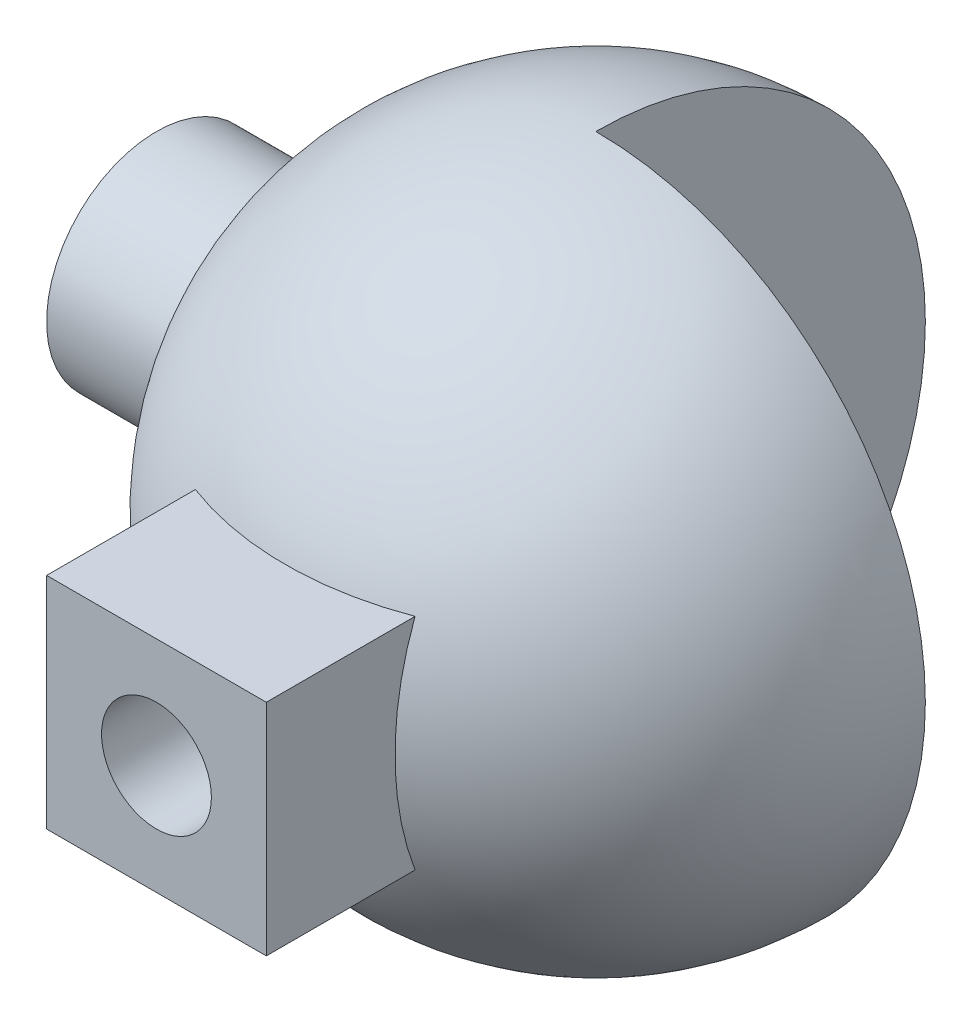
ISO-10303-21;
HEADER;
FILE_DESCRIPTION(('STEP AP214'),'2;1');
FILE_NAME('part.step','',(''),(''),'','','');
FILE_SCHEMA(('AUTOMOTIVE_DESIGN { 1 0 10303 214 1 1 1 1 }'));
ENDSEC;
DATA;
#1=APPLICATION_CONTEXT('core data for automotive mechanical design processes');
#2=APPLICATION_PROTOCOL_DEFINITION('international standard','automotive_design',2000,#1);
#3=PRODUCT_CONTEXT('',#1,'mechanical');
#4=PRODUCT('Part','Part','',(#3));
#5=PRODUCT_RELATED_PRODUCT_CATEGORY('part','',(#4));
#6=PRODUCT_DEFINITION_FORMATION('','',#4);
#7=PRODUCT_DEFINITION_CONTEXT('part definition',#1,'design');
#8=PRODUCT_DEFINITION('design','',#6,#7);
#9=PRODUCT_DEFINITION_SHAPE('','',#8);
#10=(LENGTH_UNIT() NAMED_UNIT(*) SI_UNIT(.MILLI.,.METRE.));
#11=(NAMED_UNIT(*) PLANE_ANGLE_UNIT() SI_UNIT($,.RADIAN.));
#12=(NAMED_UNIT(*) SI_UNIT($,.STERADIAN.) SOLID_ANGLE_UNIT());
#13=UNCERTAINTY_MEASURE_WITH_UNIT(LENGTH_MEASURE(1.E-05),#10,'distance_accuracy_value','');
#14=(GEOMETRIC_REPRESENTATION_CONTEXT(3) GLOBAL_UNCERTAINTY_ASSIGNED_CONTEXT((#13)) GLOBAL_UNIT_ASSIGNED_CONTEXT((#10,
#11,#12)) REPRESENTATION_CONTEXT('',''));
#15=CARTESIAN_POINT('',(0.,0.,0.));
#16=DIRECTION('',(0.,0.,1.));
#17=DIRECTION('',(1.,0.,0.));
#18=AXIS2_PLACEMENT_3D('',#15,#16,#17);
#19=CARTESIAN_POINT('',(0.,0.,0.));
#20=DIRECTION('',(1.,0.,0.));
#21=DIRECTION('',(0.,0.,-1.));
#22=AXIS2_PLACEMENT_3D('',#19,#20,#21);
#23=PLANE('',#22);
#24=DIRECTION('',(0.,1.,0.));
#25=VECTOR('',#24,1.);
#26=CARTESIAN_POINT('',(0.,5.,5.));
#27=LINE('',#26,#25);
#28=CARTESIAN_POINT('',(0.,-5.,5.));
#29=VERTEX_POINT('',#28);
#30=CARTESIAN_POINT('',(0.,5.,5.));
#31=VERTEX_POINT('',#30);
#32=EDGE_CURVE('E120',#29,#31,#27,.T.);
#33=ORIENTED_EDGE('',*,*,#32,.T.);
#34=DIRECTION('',(0.,0.,1.));
#35=VECTOR('',#34,1.);
#36=CARTESIAN_POINT('',(0.,5.,-14.142135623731));
#37=LINE('',#36,#35);
#38=CARTESIAN_POINT('',(0.,5.,8.66025403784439));
#39=VERTEX_POINT('',#38);
#40=EDGE_CURVE('E156',#39,#31,#37,.F.);
#41=ORIENTED_EDGE('',*,*,#40,.F.);
#42=CARTESIAN_POINT('',(0.,0.,0.));
#43=DIRECTION('',(1.,0.,0.));
#44=DIRECTION('',(0.,0.,-1.));
#45=AXIS2_PLACEMENT_3D('',#42,#43,#44);
#46=CIRCLE('',#45,10.);
#47=CARTESIAN_POINT('',(0.,-5.,8.66025403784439));
#48=VERTEX_POINT('',#47);
#49=EDGE_CURVE('E144',#39,#48,#46,.T.);
#50=ORIENTED_EDGE('',*,*,#49,.T.);
#51=DIRECTION('',(0.,0.,1.));
#52=VECTOR('',#51,1.);
#53=CARTESIAN_POINT('',(0.,-5.,-14.142135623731));
#54=LINE('',#53,#52);
#55=EDGE_CURVE('E142',#29,#48,#54,.T.);
#56=ORIENTED_EDGE('',*,*,#55,.F.);
#57=EDGE_LOOP('',(#33,#41,#50,#56));
#58=FACE_BOUND('',#57,.T.);
#59=ADVANCED_FACE('F31',(#58),#23,.T.);
#60=CARTESIAN_POINT('',(0.,0.,0.));
#61=DIRECTION('',(0.,1.,0.));
#62=DIRECTION('',(0.,0.,-1.));
#63=AXIS2_PLACEMENT_3D('',#60,#61,#62);
#64=SPHERICAL_SURFACE('',#63,30.);
#65=CARTESIAN_POINT('',(-28.2842712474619,0.,0.));
#66=DIRECTION('',(1.,0.,0.));
#67=DIRECTION('',(0.,0.,-1.));
#68=AXIS2_PLACEMENT_3D('',#65,#66,#67);
#69=CIRCLE('',#68,10.);
#70=CARTESIAN_POINT('',(-28.2842712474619,0.,-10.));
#71=VERTEX_POINT('',#70);
#72=EDGE_CURVE('E157',#71,#71,#69,.T.);
#73=ORIENTED_EDGE('',*,*,#72,.T.);
#74=EDGE_LOOP('',(#73));
#75=FACE_BOUND('',#74,.T.);
#76=CARTESIAN_POINT('',(0.,0.,0.));
#77=DIRECTION('',(0.,0.,1.));
#78=DIRECTION('',(1.,0.,0.));
#79=AXIS2_PLACEMENT_3D('',#76,#77,#78);
#80=CIRCLE('',#79,30.);
#81=CARTESIAN_POINT('',(0.,-30.,0.));
#82=VERTEX_POINT('',#81);
#83=CARTESIAN_POINT('',(0.,30.,0.));
#84=VERTEX_POINT('',#83);
#85=EDGE_CURVE('E196',#82,#84,#80,.T.);
#86=ORIENTED_EDGE('',*,*,#85,.T.);
#87=CARTESIAN_POINT('',(0.,0.,0.));
#88=DIRECTION('',(1.,0.,0.));
#89=DIRECTION('',(0.,0.,-1.));
#90=AXIS2_PLACEMENT_3D('',#87,#88,#89);
#91=CIRCLE('',#90,30.);
#92=EDGE_CURVE('E199',#82,#84,#91,.T.);
#93=ORIENTED_EDGE('',*,*,#92,.F.);
#94=EDGE_LOOP('',(#86,#93));
#95=FACE_BOUND('',#94,.T.);
#96=CARTESIAN_POINT('',(-10.,0.,0.));
#97=DIRECTION('',(1.,0.,0.));
#98=DIRECTION('',(0.,1.,0.));
#99=AXIS2_PLACEMENT_3D('',#96,#97,#98);
#100=CIRCLE('',#99,28.2842712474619);
#101=CARTESIAN_POINT('',(-10.,10.,26.4575131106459));
#102=VERTEX_POINT('',#101);
#103=CARTESIAN_POINT('',(-10.,-10.,26.4575131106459));
#104=VERTEX_POINT('',#103);
#105=EDGE_CURVE('E44',#102,#104,#100,.T.);
#106=ORIENTED_EDGE('',*,*,#105,.F.);
#107=CARTESIAN_POINT('',(0.,10.,0.));
#108=DIRECTION('',(0.,-1.,0.));
#109=DIRECTION('',(0.,0.,-1.));
#110=AXIS2_PLACEMENT_3D('',#107,#108,#109);
#111=CIRCLE('',#110,28.2842712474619);
#112=CARTESIAN_POINT('',(10.,10.,26.4575131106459));
#113=VERTEX_POINT('',#112);
#114=EDGE_CURVE('E189',#113,#102,#111,.T.);
#115=ORIENTED_EDGE('',*,*,#114,.F.);
#116=CARTESIAN_POINT('',(10.,0.,0.));
#117=DIRECTION('',(-1.,0.,0.));
#118=DIRECTION('',(0.,0.,1.));
#119=AXIS2_PLACEMENT_3D('',#116,#117,#118);
#120=CIRCLE('',#119,28.2842712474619);
#121=CARTESIAN_POINT('',(10.,-10.,26.4575131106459));
#122=VERTEX_POINT('',#121);
#123=EDGE_CURVE('E192',#122,#113,#120,.T.);
#124=ORIENTED_EDGE('',*,*,#123,.F.);
#125=CARTESIAN_POINT('',(0.,-10.,0.));
#126=DIRECTION('',(0.,1.,0.));
#127=DIRECTION('',(0.,0.,1.));
#128=AXIS2_PLACEMENT_3D('',#125,#126,#127);
#129=CIRCLE('',#128,28.2842712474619);
#130=EDGE_CURVE('E59',#104,#122,#129,.T.);
#131=ORIENTED_EDGE('',*,*,#130,.F.);
#132=EDGE_LOOP('',(#106,#115,#124,#131));
#133=FACE_BOUND('',#132,.T.);
#134=ADVANCED_FACE('F33',(#75,#95,#133),#64,.T.);
#135=DIRECTION('',(0.,0.,1.));
#136=VECTOR('',#135,1.);
#137=CARTESIAN_POINT('',(0.,-5.,-5.00000000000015));
#138=LINE('',#137,#136);
#139=CARTESIAN_POINT('',(0.,-5.,-5.));
#140=VERTEX_POINT('',#139);
#141=CARTESIAN_POINT('',(0.,-5.,0.));
#142=VERTEX_POINT('',#141);
#143=EDGE_CURVE('E139',#140,#142,#138,.T.);
#144=ORIENTED_EDGE('',*,*,#143,.T.);
#145=DIRECTION('',(0.,-1.,0.));
#146=VECTOR('',#145,1.);
#147=CARTESIAN_POINT('',(0.,30.,0.));
#148=LINE('',#147,#146);
#149=EDGE_CURVE('E202',#142,#82,#148,.T.);
#150=ORIENTED_EDGE('',*,*,#149,.T.);
#151=ORIENTED_EDGE('',*,*,#92,.T.);
#152=CARTESIAN_POINT('',(0.,5.,0.));
#153=VERTEX_POINT('',#152);
#154=EDGE_CURVE('E203',#84,#153,#148,.T.);
#155=ORIENTED_EDGE('',*,*,#154,.T.);
#156=DIRECTION('',(0.,0.,-1.));
#157=VECTOR('',#156,1.);
#158=CARTESIAN_POINT('',(0.,5.,-5.00000000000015));
#159=LINE('',#158,#157);
#160=CARTESIAN_POINT('',(0.,5.,-5.));
#161=VERTEX_POINT('',#160);
#162=EDGE_CURVE('E260',#153,#161,#159,.T.);
#163=ORIENTED_EDGE('',*,*,#162,.T.);
#164=DIRECTION('',(0.,-1.,0.));
#165=VECTOR('',#164,1.);
#166=CARTESIAN_POINT('',(0.,5.,-5.));
#167=LINE('',#166,#165);
#168=EDGE_CURVE('E247',#161,#140,#167,.T.);
#169=ORIENTED_EDGE('',*,*,#168,.T.);
#170=EDGE_LOOP('',(#144,#150,#151,#155,#163,#169));
#171=FACE_BOUND('',#170,.T.);
#172=ADVANCED_FACE('F231',(#171),#23,.T.);
#173=CARTESIAN_POINT('',(0.,0.,0.));
#174=DIRECTION('',(0.,0.,1.));
#175=DIRECTION('',(1.,0.,0.));
#176=AXIS2_PLACEMENT_3D('',#173,#174,#175);
#177=PLANE('',#176);
#178=ORIENTED_EDGE('',*,*,#149,.F.);
#179=CARTESIAN_POINT('',(0.,0.,0.));
#180=DIRECTION('',(0.,0.,1.));
#181=DIRECTION('',(1.,0.,0.));
#182=AXIS2_PLACEMENT_3D('',#179,#180,#181);
#183=CIRCLE('',#182,5.);
#184=EDGE_CURVE('E154',#153,#142,#183,.F.);
#185=ORIENTED_EDGE('',*,*,#184,.F.);
#186=ORIENTED_EDGE('',*,*,#154,.F.);
#187=ORIENTED_EDGE('',*,*,#85,.F.);
#188=EDGE_LOOP('',(#178,#185,#186,#187));
#189=FACE_BOUND('',#188,.T.);
#190=ADVANCED_FACE('F238',(#189),#177,.F.);
#191=CARTESIAN_POINT('',(-10.,10.,40.));
#192=DIRECTION('',(1.,0.,0.));
#193=DIRECTION('',(0.,1.,0.));
#194=AXIS2_PLACEMENT_3D('',#191,#192,#193);
#195=PLANE('',#194);
#196=DIRECTION('',(0.,0.,-1.));
#197=VECTOR('',#196,1.);
#198=CARTESIAN_POINT('',(-10.,10.,40.));
#199=LINE('',#198,#197);
#200=CARTESIAN_POINT('',(-10.,10.,40.));
#201=VERTEX_POINT('',#200);
#202=EDGE_CURVE('E177',#201,#102,#199,.T.);
#203=ORIENTED_EDGE('',*,*,#202,.T.);
#204=ORIENTED_EDGE('',*,*,#105,.T.);
#205=DIRECTION('',(0.,0.,-1.));
#206=VECTOR('',#205,1.);
#207=CARTESIAN_POINT('',(-10.,-10.,40.));
#208=LINE('',#207,#206);
#209=CARTESIAN_POINT('',(-10.,-10.,40.));
#210=VERTEX_POINT('',#209);
#211=EDGE_CURVE('E186',#210,#104,#208,.T.);
#212=ORIENTED_EDGE('',*,*,#211,.F.);
#213=DIRECTION('',(0.,-1.,0.));
#214=VECTOR('',#213,1.);
#215=CARTESIAN_POINT('',(-10.,10.,40.));
#216=LINE('',#215,#214);
#217=EDGE_CURVE('E168',#201,#210,#216,.T.);
#218=ORIENTED_EDGE('',*,*,#217,.F.);
#219=EDGE_LOOP('',(#203,#204,#212,#218));
#220=FACE_BOUND('',#219,.T.);
#221=ADVANCED_FACE('F207',(#220),#195,.F.);
#222=CARTESIAN_POINT('',(-10.,-10.,40.));
#223=DIRECTION('',(0.,1.,0.));
#224=DIRECTION('',(0.,0.,1.));
#225=AXIS2_PLACEMENT_3D('',#222,#223,#224);
#226=PLANE('',#225);
#227=ORIENTED_EDGE('',*,*,#211,.T.);
#228=ORIENTED_EDGE('',*,*,#130,.T.);
#229=DIRECTION('',(0.,0.,-1.));
#230=VECTOR('',#229,1.);
#231=CARTESIAN_POINT('',(10.,-10.,40.));
#232=LINE('',#231,#230);
#233=CARTESIAN_POINT('',(10.,-10.,40.));
#234=VERTEX_POINT('',#233);
#235=EDGE_CURVE('E183',#234,#122,#232,.T.);
#236=ORIENTED_EDGE('',*,*,#235,.F.);
#237=DIRECTION('',(1.,0.,0.));
#238=VECTOR('',#237,1.);
#239=CARTESIAN_POINT('',(-10.,-10.,40.));
#240=LINE('',#239,#238);
#241=EDGE_CURVE('E171',#210,#234,#240,.T.);
#242=ORIENTED_EDGE('',*,*,#241,.F.);
#243=EDGE_LOOP('',(#227,#228,#236,#242));
#244=FACE_BOUND('',#243,.T.);
#245=ADVANCED_FACE('F211',(#244),#226,.F.);
#246=CARTESIAN_POINT('',(10.,10.,40.));
#247=DIRECTION('',(-1.,0.,0.));
#248=DIRECTION('',(0.,0.,1.));
#249=AXIS2_PLACEMENT_3D('',#246,#247,#248);
#250=PLANE('',#249);
#251=ORIENTED_EDGE('',*,*,#235,.T.);
#252=ORIENTED_EDGE('',*,*,#123,.T.);
#253=DIRECTION('',(0.,0.,-1.));
#254=VECTOR('',#253,1.);
#255=CARTESIAN_POINT('',(10.,10.,40.));
#256=LINE('',#255,#254);
#257=CARTESIAN_POINT('',(10.,10.,40.));
#258=VERTEX_POINT('',#257);
#259=EDGE_CURVE('E180',#258,#113,#256,.T.);
#260=ORIENTED_EDGE('',*,*,#259,.F.);
#261=DIRECTION('',(0.,1.,0.));
#262=VECTOR('',#261,1.);
#263=CARTESIAN_POINT('',(10.,10.,40.));
#264=LINE('',#263,#262);
#265=EDGE_CURVE('E173',#234,#258,#264,.T.);
#266=ORIENTED_EDGE('',*,*,#265,.F.);
#267=EDGE_LOOP('',(#251,#252,#260,#266));
#268=FACE_BOUND('',#267,.T.);
#269=ADVANCED_FACE('F221',(#268),#250,.F.);
#270=CARTESIAN_POINT('',(-10.,10.,40.));
#271=DIRECTION('',(0.,-1.,0.));
#272=DIRECTION('',(0.,0.,-1.));
#273=AXIS2_PLACEMENT_3D('',#270,#271,#272);
#274=PLANE('',#273);
#275=ORIENTED_EDGE('',*,*,#259,.T.);
#276=ORIENTED_EDGE('',*,*,#114,.T.);
#277=ORIENTED_EDGE('',*,*,#202,.F.);
#278=DIRECTION('',(-1.,0.,0.));
#279=VECTOR('',#278,1.);
#280=CARTESIAN_POINT('',(-10.,10.,40.));
#281=LINE('',#280,#279);
#282=EDGE_CURVE('E175',#258,#201,#281,.T.);
#283=ORIENTED_EDGE('',*,*,#282,.F.);
#284=EDGE_LOOP('',(#275,#276,#277,#283));
#285=FACE_BOUND('',#284,.T.);
#286=ADVANCED_FACE('F219',(#285),#274,.F.);
#287=CARTESIAN_POINT('',(-10.,-10.,40.));
#288=DIRECTION('',(0.,0.,1.));
#289=DIRECTION('',(1.,0.,0.));
#290=AXIS2_PLACEMENT_3D('',#287,#288,#289);
#291=PLANE('',#290);
#292=CARTESIAN_POINT('',(0.,0.,40.));
#293=DIRECTION('',(0.,0.,1.));
#294=DIRECTION('',(1.,0.,0.));
#295=AXIS2_PLACEMENT_3D('',#292,#293,#294);
#296=CIRCLE('',#295,5.);
#297=CARTESIAN_POINT('',(5.,0.,40.));
#298=VERTEX_POINT('',#297);
#299=EDGE_CURVE('E164',#298,#298,#296,.T.);
#300=ORIENTED_EDGE('',*,*,#299,.F.);
#301=EDGE_LOOP('',(#300));
#302=FACE_BOUND('',#301,.T.);
#303=ORIENTED_EDGE('',*,*,#217,.T.);
#304=ORIENTED_EDGE('',*,*,#241,.T.);
#305=ORIENTED_EDGE('',*,*,#265,.T.);
#306=ORIENTED_EDGE('',*,*,#282,.T.);
#307=EDGE_LOOP('',(#303,#304,#305,#306));
#308=FACE_BOUND('',#307,.T.);
#309=ADVANCED_FACE('F215',(#302,#308),#291,.T.);
#310=CARTESIAN_POINT('',(0.,0.,-14.142135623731));
#311=DIRECTION('',(0.,0.,1.));
#312=DIRECTION('',(1.,0.,0.));
#313=AXIS2_PLACEMENT_3D('',#310,#311,#312);
#314=CYLINDRICAL_SURFACE('',#313,5.);
#315=CARTESIAN_POINT('',(0.,-5.,8.66025403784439));
#316=CARTESIAN_POINT('',(-0.130944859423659,-5.00002361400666,8.66021552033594));
#317=CARTESIAN_POINT('',(-0.261868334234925,-4.9948568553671,8.66322292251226));
#318=CARTESIAN_POINT('',(-0.522571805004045,-4.97432835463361,8.67503956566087));
#319=CARTESIAN_POINT('',(-0.65235245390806,-4.95897287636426,8.68384524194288));
#320=CARTESIAN_POINT('',(-0.909095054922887,-4.91836897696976,8.70690282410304));
#321=CARTESIAN_POINT('',(-1.03606889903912,-4.8931777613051,8.72112322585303));
#322=CARTESIAN_POINT('',(-1.28705526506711,-4.83323443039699,8.75448565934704));
#323=CARTESIAN_POINT('',(-1.41106744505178,-4.79848121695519,8.77362825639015));
#324=CARTESIAN_POINT('',(-1.77692778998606,-4.68059421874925,8.83742418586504));
#325=CARTESIAN_POINT('',(-2.01337636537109,-4.58370758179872,8.888521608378));
#326=CARTESIAN_POINT('',(-2.46683536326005,-4.35652191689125,9.00204283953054));
#327=CARTESIAN_POINT('',(-2.68381495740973,-4.22617111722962,9.06448415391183));
#328=CARTESIAN_POINT('',(-3.11153612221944,-3.92332753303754,9.19984832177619));
#329=CARTESIAN_POINT('',(-3.32031604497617,-3.74825998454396,9.27321075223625));
#330=CARTESIAN_POINT('',(-3.70710934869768,-3.36618253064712,9.41862456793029));
#331=CARTESIAN_POINT('',(-3.88511438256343,-3.15916398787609,9.49067559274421));
#332=CARTESIAN_POINT('',(-4.13122602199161,-2.82033262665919,9.59484425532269));
#333=CARTESIAN_POINT('',(-4.2119123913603,-2.69838307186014,9.62993521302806));
#334=CARTESIAN_POINT('',(-4.36262742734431,-2.44722349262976,9.6968010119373));
#335=CARTESIAN_POINT('',(-4.43266031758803,-2.31801637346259,9.72857716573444));
#336=CARTESIAN_POINT('',(-4.56137508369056,-2.0531765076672,9.78789466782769));
#337=CARTESIAN_POINT('',(-4.62005980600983,-1.91754538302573,9.8154370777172));
#338=CARTESIAN_POINT('',(-4.72543066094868,-1.64079804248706,9.86547225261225));
#339=CARTESIAN_POINT('',(-4.77211806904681,-1.49968241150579,9.88796555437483));
#340=CARTESIAN_POINT('',(-4.85001520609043,-1.22330545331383,9.92580345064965));
#341=CARTESIAN_POINT('',(-4.88208958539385,-1.0883415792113,9.94154270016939));
#342=CARTESIAN_POINT('',(-4.93496565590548,-0.815713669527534,9.96761533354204));
#343=CARTESIAN_POINT('',(-4.95576844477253,-0.678049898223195,9.97794924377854));
#344=CARTESIAN_POINT('',(-4.98581948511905,-0.401222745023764,9.99290878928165));
#345=CARTESIAN_POINT('',(-4.99507312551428,-0.262060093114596,9.99753708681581));
#346=CARTESIAN_POINT('',(-5.00191437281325,0.016619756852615,10.0009568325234));
#347=CARTESIAN_POINT('',(-4.99950269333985,0.156136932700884,9.99974863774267));
#348=CARTESIAN_POINT('',(-4.98376932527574,0.422159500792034,9.99189259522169));
#349=CARTESIAN_POINT('',(-4.97141799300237,0.548737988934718,9.98572860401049));
#350=CARTESIAN_POINT('',(-4.93716668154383,0.80031714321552,9.96872078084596));
#351=CARTESIAN_POINT('',(-4.91526368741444,0.925317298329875,9.95787547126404));
#352=CARTESIAN_POINT('',(-4.86215232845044,1.17280949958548,9.93176665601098));
#353=CARTESIAN_POINT('',(-4.8309472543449,1.29530241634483,9.91650471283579));
#354=CARTESIAN_POINT('',(-4.75955157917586,1.53706975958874,9.88192118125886));
#355=CARTESIAN_POINT('',(-4.71935753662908,1.65634293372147,9.86259803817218));
#356=CARTESIAN_POINT('',(-4.58462612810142,2.0114016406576,9.79859254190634));
#357=CARTESIAN_POINT('',(-4.47663263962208,2.24122379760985,9.74822697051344));
#358=CARTESIAN_POINT('',(-4.2286723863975,2.6799208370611,9.63687905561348));
#359=CARTESIAN_POINT('',(-4.08869370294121,2.88878786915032,9.57589275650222));
#360=CARTESIAN_POINT('',(-3.76554744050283,3.30083676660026,9.44222809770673));
#361=CARTESIAN_POINT('',(-3.57954941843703,3.50161847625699,9.36898946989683));
#362=CARTESIAN_POINT('',(-3.17703902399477,3.8705258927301,9.22271533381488));
#363=CARTESIAN_POINT('',(-2.96049948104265,4.03862220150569,9.14968006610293));
#364=CARTESIAN_POINT('',(-2.6087212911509,4.26800936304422,9.04388357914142));
#365=CARTESIAN_POINT('',(-2.48277337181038,4.34250455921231,9.00825027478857));
#366=CARTESIAN_POINT('',(-2.22412506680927,4.48048286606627,8.94042357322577));
#367=CARTESIAN_POINT('',(-2.09142768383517,4.54397081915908,8.90822866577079));
#368=CARTESIAN_POINT('',(-1.82030057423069,4.65920157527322,8.84850577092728));
#369=CARTESIAN_POINT('',(-1.6818817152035,4.71096553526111,8.82096939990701));
#370=CARTESIAN_POINT('',(-1.40014821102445,4.80224062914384,8.77161166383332));
#371=CARTESIAN_POINT('',(-1.25683571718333,4.84175707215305,8.74978782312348));
#372=CARTESIAN_POINT('',(-0.930510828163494,4.91615453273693,8.70825525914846));
#373=CARTESIAN_POINT('',(-0.746421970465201,4.94749058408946,8.69039463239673));
#374=CARTESIAN_POINT('',(-0.467930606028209,4.97893750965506,8.67238767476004));
#375=CARTESIAN_POINT('',(-0.374609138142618,4.98682704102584,8.66784921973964));
#376=CARTESIAN_POINT('',(-0.187535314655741,4.99736013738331,8.66177877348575));
#377=CARTESIAN_POINT('',(-0.0937827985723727,5.00000155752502,8.66024801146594));
#378=CARTESIAN_POINT('',(0.,5.,8.66025403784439));
#379=B_SPLINE_CURVE_WITH_KNOTS('',3,(#315,#316,#317,#318,#319,#320,#321,#322,#323,#324,#325,
#326,#327,#328,#329,#330,#331,#332,#333,#334,#335,#336,#337,#338,#339,#340,#341,#342,#343,#344,
#345,#346,#347,#348,#349,#350,#351,#352,#353,#354,#355,#356,#357,#358,#359,#360,#361,#362,#363,
#364,#365,#366,#367,#368,#369,#370,#371,#372,#373,#374,#375,#376,#377,#378),.UNSPECIFIED.,.F.,
.F.,(4,2,2,2,2,2,2,2,2,2,2,2,2,2,2,2,2,2,2,2,2,2,2,2,2,2,2,2,2,2,2,4),(0.,0.39266311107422,
0.785085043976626,1.17525782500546,1.56547543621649,2.3435695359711,3.12287474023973,
3.96591805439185,4.80918967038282,5.2598277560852,5.71028671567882,6.16063253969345,
6.6109304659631,7.02920191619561,7.4474326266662,7.8654681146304,8.28347802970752,
8.66501292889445,9.04666834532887,9.42818890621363,9.80985578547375,10.5829611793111,
11.3563551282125,12.2027949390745,13.0499925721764,13.5013153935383,13.9524391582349,
14.4027422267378,14.8528498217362,15.4139318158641,15.695056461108,15.9762959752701),.UNSPECIFIED.);
#380=EDGE_CURVE('E11',#48,#39,#379,.T.);
#381=ORIENTED_EDGE('',*,*,#380,.T.);
#382=ORIENTED_EDGE('',*,*,#40,.T.);
#383=EDGE_CURVE('E259',#31,#153,#159,.T.);
#384=ORIENTED_EDGE('',*,*,#383,.T.);
#385=ORIENTED_EDGE('',*,*,#184,.T.);
#386=EDGE_CURVE('E134',#142,#29,#54,.T.);
#387=ORIENTED_EDGE('',*,*,#386,.T.);
#388=ORIENTED_EDGE('',*,*,#55,.T.);
#389=EDGE_LOOP('',(#381,#382,#384,#385,#387,#388));
#390=FACE_BOUND('',#389,.T.);
#391=ORIENTED_EDGE('',*,*,#299,.T.);
#392=EDGE_LOOP('',(#391));
#393=FACE_BOUND('',#392,.T.);
#394=ADVANCED_FACE('F150',(#390,#393),#314,.F.);
#395=CARTESIAN_POINT('',(-40.,0.,0.));
#396=DIRECTION('',(1.,0.,0.));
#397=DIRECTION('',(0.,0.,-1.));
#398=AXIS2_PLACEMENT_3D('',#395,#396,#397);
#399=CYLINDRICAL_SURFACE('',#398,10.);
#400=ORIENTED_EDGE('',*,*,#380,.F.);
#401=ORIENTED_EDGE('',*,*,#49,.F.);
#402=EDGE_LOOP('',(#400,#401));
#403=FACE_BOUND('',#402,.T.);
#404=ADVANCED_FACE('F279',(#403),#399,.T.);
#405=CARTESIAN_POINT('',(-40.,0.,0.));
#406=DIRECTION('',(1.,0.,0.));
#407=DIRECTION('',(0.,0.,-1.));
#408=AXIS2_PLACEMENT_3D('',#405,#406,#407);
#409=CIRCLE('',#408,10.);
#410=CARTESIAN_POINT('',(-40.,0.,-10.));
#411=VERTEX_POINT('',#410);
#412=EDGE_CURVE('E147',#411,#411,#409,.T.);
#413=ORIENTED_EDGE('',*,*,#412,.T.);
#414=EDGE_LOOP('',(#413));
#415=FACE_BOUND('',#414,.T.);
#416=ORIENTED_EDGE('',*,*,#72,.F.);
#417=EDGE_LOOP('',(#416));
#418=FACE_BOUND('',#417,.T.);
#419=ADVANCED_FACE('F267',(#415,#418),#399,.T.);
#420=CARTESIAN_POINT('',(-40.,0.,0.));
#421=DIRECTION('',(1.,0.,0.));
#422=DIRECTION('',(0.,0.,-1.));
#423=AXIS2_PLACEMENT_3D('',#420,#421,#422);
#424=PLANE('',#423);
#425=DIRECTION('',(0.,1.,0.));
#426=VECTOR('',#425,1.);
#427=CARTESIAN_POINT('',(-40.,5.,5.));
#428=LINE('',#427,#426);
#429=CARTESIAN_POINT('',(-40.,-5.,5.));
#430=VERTEX_POINT('',#429);
#431=CARTESIAN_POINT('',(-40.,5.,5.));
#432=VERTEX_POINT('',#431);
#433=EDGE_CURVE('E250',#430,#432,#428,.T.);
#434=ORIENTED_EDGE('',*,*,#433,.F.);
#435=DIRECTION('',(0.,0.,1.));
#436=VECTOR('',#435,1.);
#437=CARTESIAN_POINT('',(-40.,-5.,-5.));
#438=LINE('',#437,#436);
#439=CARTESIAN_POINT('',(-40.,-5.,-5.));
#440=VERTEX_POINT('',#439);
#441=EDGE_CURVE('E137',#440,#430,#438,.T.);
#442=ORIENTED_EDGE('',*,*,#441,.F.);
#443=DIRECTION('',(0.,-1.,0.));
#444=VECTOR('',#443,1.);
#445=CARTESIAN_POINT('',(-40.,5.,-5.));
#446=LINE('',#445,#444);
#447=CARTESIAN_POINT('',(-40.,5.,-5.));
#448=VERTEX_POINT('',#447);
#449=EDGE_CURVE('E254',#448,#440,#446,.T.);
#450=ORIENTED_EDGE('',*,*,#449,.F.);
#451=DIRECTION('',(0.,0.,-1.));
#452=VECTOR('',#451,1.);
#453=CARTESIAN_POINT('',(-40.,5.,-5.));
#454=LINE('',#453,#452);
#455=EDGE_CURVE('E51',#432,#448,#454,.T.);
#456=ORIENTED_EDGE('',*,*,#455,.F.);
#457=EDGE_LOOP('',(#434,#442,#450,#456));
#458=FACE_BOUND('',#457,.T.);
#459=ORIENTED_EDGE('',*,*,#412,.F.);
#460=EDGE_LOOP('',(#459));
#461=FACE_BOUND('',#460,.T.);
#462=ADVANCED_FACE('F270',(#458,#461),#424,.F.);
#463=CARTESIAN_POINT('',(14.142135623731,-5.,-5.));
#464=DIRECTION('',(0.,-1.,0.));
#465=DIRECTION('',(0.,0.,-1.));
#466=AXIS2_PLACEMENT_3D('',#463,#464,#465);
#467=PLANE('',#466);
#468=DIRECTION('',(-1.,0.,0.));
#469=VECTOR('',#468,1.);
#470=CARTESIAN_POINT('',(14.142135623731,-5.,-5.));
#471=LINE('',#470,#469);
#472=EDGE_CURVE('E257',#140,#440,#471,.T.);
#473=ORIENTED_EDGE('',*,*,#472,.T.);
#474=ORIENTED_EDGE('',*,*,#441,.T.);
#475=DIRECTION('',(-1.,0.,0.));
#476=VECTOR('',#475,1.);
#477=CARTESIAN_POINT('',(14.142135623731,-5.,5.));
#478=LINE('',#477,#476);
#479=EDGE_CURVE('E124',#29,#430,#478,.T.);
#480=ORIENTED_EDGE('',*,*,#479,.F.);
#481=ORIENTED_EDGE('',*,*,#386,.F.);
#482=ORIENTED_EDGE('',*,*,#143,.F.);
#483=EDGE_LOOP('',(#473,#474,#480,#481,#482));
#484=FACE_BOUND('',#483,.T.);
#485=ADVANCED_FACE('F132',(#484),#467,.F.);
#486=CARTESIAN_POINT('',(14.142135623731,5.,5.));
#487=DIRECTION('',(0.,0.,1.));
#488=DIRECTION('',(1.,0.,0.));
#489=AXIS2_PLACEMENT_3D('',#486,#487,#488);
#490=PLANE('',#489);
#491=ORIENTED_EDGE('',*,*,#479,.T.);
#492=ORIENTED_EDGE('',*,*,#433,.T.);
#493=DIRECTION('',(-1.,0.,0.));
#494=VECTOR('',#493,1.);
#495=CARTESIAN_POINT('',(14.142135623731,5.,5.));
#496=LINE('',#495,#494);
#497=EDGE_CURVE('E126',#31,#432,#496,.T.);
#498=ORIENTED_EDGE('',*,*,#497,.F.);
#499=ORIENTED_EDGE('',*,*,#32,.F.);
#500=EDGE_LOOP('',(#491,#492,#498,#499));
#501=FACE_BOUND('',#500,.T.);
#502=ADVANCED_FACE('F122',(#501),#490,.F.);
#503=CARTESIAN_POINT('',(14.142135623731,5.,-5.));
#504=DIRECTION('',(0.,1.,0.));
#505=DIRECTION('',(0.,0.,1.));
#506=AXIS2_PLACEMENT_3D('',#503,#504,#505);
#507=PLANE('',#506);
#508=ORIENTED_EDGE('',*,*,#497,.T.);
#509=ORIENTED_EDGE('',*,*,#455,.T.);
#510=DIRECTION('',(-1.,0.,0.));
#511=VECTOR('',#510,1.);
#512=CARTESIAN_POINT('',(14.142135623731,5.,-5.));
#513=LINE('',#512,#511);
#514=EDGE_CURVE('E258',#161,#448,#513,.T.);
#515=ORIENTED_EDGE('',*,*,#514,.F.);
#516=ORIENTED_EDGE('',*,*,#162,.F.);
#517=ORIENTED_EDGE('',*,*,#383,.F.);
#518=EDGE_LOOP('',(#508,#509,#515,#516,#517));
#519=FACE_BOUND('',#518,.T.);
#520=ADVANCED_FACE('F376',(#519),#507,.F.);
#521=CARTESIAN_POINT('',(14.142135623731,5.,-5.));
#522=DIRECTION('',(0.,0.,-1.));
#523=DIRECTION('',(0.,1.,0.));
#524=AXIS2_PLACEMENT_3D('',#521,#522,#523);
#525=PLANE('',#524);
#526=ORIENTED_EDGE('',*,*,#514,.T.);
#527=ORIENTED_EDGE('',*,*,#449,.T.);
#528=ORIENTED_EDGE('',*,*,#472,.F.);
#529=ORIENTED_EDGE('',*,*,#168,.F.);
#530=EDGE_LOOP('',(#526,#527,#528,#529));
#531=FACE_BOUND('',#530,.T.);
#532=ADVANCED_FACE('F383',(#531),#525,.F.);
#533=CLOSED_SHELL('',(#59,#134,#172,#190,#221,#245,#269,#286,#309,#394,#404,#419,#462,#485,#502,
#520,#532));
#534=MANIFOLD_SOLID_BREP('B2',#533);
#535=ADVANCED_BREP_SHAPE_REPRESENTATION('',(#18,#534),#14);
#536=SHAPE_DEFINITION_REPRESENTATION(#9,#535);
ENDSEC;
END-ISO-10303-21;
